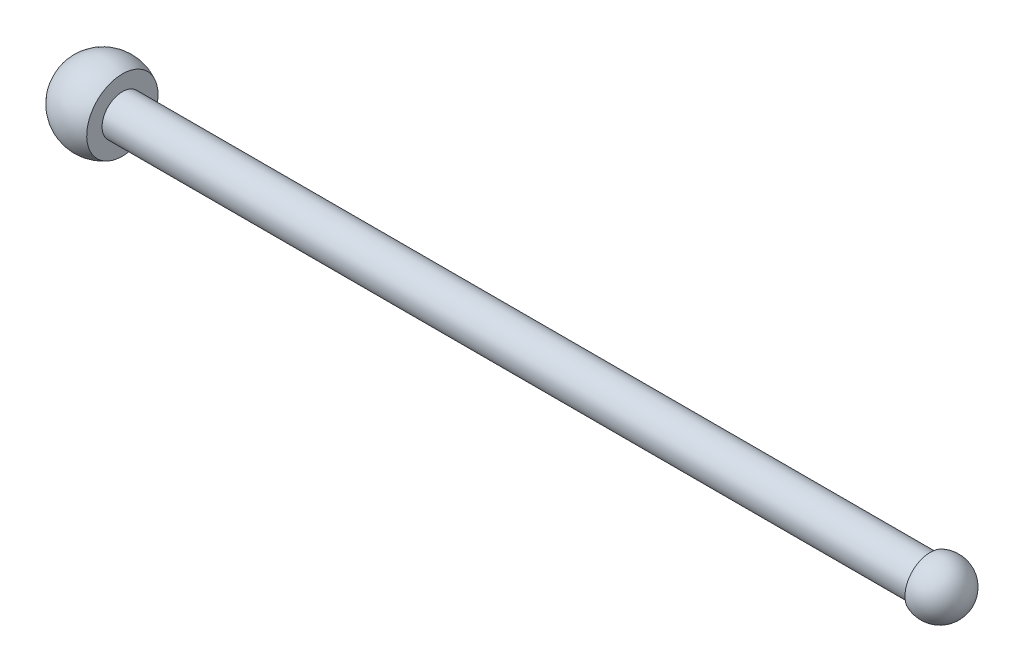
ISO-10303-21;
HEADER;
FILE_DESCRIPTION(('STEP AP214'),'2;1');
FILE_NAME('part.step','',(''),(''),'','','');
FILE_SCHEMA(('AUTOMOTIVE_DESIGN { 1 0 10303 214 1 1 1 1 }'));
ENDSEC;
DATA;
#1=APPLICATION_CONTEXT('core data for automotive mechanical design processes');
#2=APPLICATION_PROTOCOL_DEFINITION('international standard','automotive_design',2000,#1);
#3=PRODUCT_CONTEXT('',#1,'mechanical');
#4=PRODUCT('Part','Part','',(#3));
#5=PRODUCT_RELATED_PRODUCT_CATEGORY('part','',(#4));
#6=PRODUCT_DEFINITION_FORMATION('','',#4);
#7=PRODUCT_DEFINITION_CONTEXT('part definition',#1,'design');
#8=PRODUCT_DEFINITION('design','',#6,#7);
#9=PRODUCT_DEFINITION_SHAPE('','',#8);
#10=(LENGTH_UNIT() NAMED_UNIT(*) SI_UNIT(.MILLI.,.METRE.));
#11=(NAMED_UNIT(*) PLANE_ANGLE_UNIT() SI_UNIT($,.RADIAN.));
#12=(NAMED_UNIT(*) SI_UNIT($,.STERADIAN.) SOLID_ANGLE_UNIT());
#13=UNCERTAINTY_MEASURE_WITH_UNIT(LENGTH_MEASURE(1.E-05),#10,'distance_accuracy_value','');
#14=(GEOMETRIC_REPRESENTATION_CONTEXT(3) GLOBAL_UNCERTAINTY_ASSIGNED_CONTEXT((#13)) GLOBAL_UNIT_ASSIGNED_CONTEXT((#10,
#11,#12)) REPRESENTATION_CONTEXT('',''));
#15=CARTESIAN_POINT('',(0.,0.,0.));
#16=DIRECTION('',(0.,0.,1.));
#17=DIRECTION('',(1.,0.,0.));
#18=AXIS2_PLACEMENT_3D('',#15,#16,#17);
#19=CARTESIAN_POINT('',(192.069433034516,11.8659256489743,0.));
#20=DIRECTION('',(1.,0.,0.));
#21=DIRECTION('',(0.,0.,-1.));
#22=AXIS2_PLACEMENT_3D('',#19,#20,#21);
#23=PLANE('',#22);
#24=DIRECTION('',(0.,-1.,0.));
#25=VECTOR('',#24,1.);
#26=CARTESIAN_POINT('',(192.069433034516,11.8659256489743,0.));
#27=LINE('',#26,#25);
#28=CARTESIAN_POINT('',(192.069433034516,11.8659256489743,0.));
#29=VERTEX_POINT('',#28);
#30=CARTESIAN_POINT('',(192.069433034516,9.525,0.));
#31=VERTEX_POINT('',#30);
#32=EDGE_CURVE('E11',#29,#31,#27,.T.);
#33=ORIENTED_EDGE('',*,*,#32,.F.);
#34=CARTESIAN_POINT('',(192.069433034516,0.,0.));
#35=DIRECTION('',(-1.,0.,0.));
#36=DIRECTION('',(0.,0.,1.));
#37=AXIS2_PLACEMENT_3D('',#34,#35,#36);
#38=CIRCLE('',#37,11.8659256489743);
#39=CARTESIAN_POINT('',(192.069433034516,0.,11.8659256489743));
#40=VERTEX_POINT('',#39);
#41=EDGE_CURVE('E66',#29,#40,#38,.T.);
#42=ORIENTED_EDGE('',*,*,#41,.T.);
#43=DIRECTION('',(0.,0.,1.));
#44=VECTOR('',#43,1.);
#45=CARTESIAN_POINT('',(192.069433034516,0.,0.));
#46=LINE('',#45,#44);
#47=CARTESIAN_POINT('',(192.069433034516,0.,9.525));
#48=VERTEX_POINT('',#47);
#49=EDGE_CURVE('E43',#48,#40,#46,.T.);
#50=ORIENTED_EDGE('',*,*,#49,.F.);
#51=CARTESIAN_POINT('',(192.069433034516,0.,0.));
#52=DIRECTION('',(1.,0.,0.));
#53=DIRECTION('',(0.,0.,-1.));
#54=AXIS2_PLACEMENT_3D('',#51,#52,#53);
#55=CIRCLE('',#54,9.525);
#56=EDGE_CURVE('E71',#48,#31,#55,.T.);
#57=ORIENTED_EDGE('',*,*,#56,.T.);
#58=EDGE_LOOP('',(#33,#42,#50,#57));
#59=FACE_BOUND('',#58,.T.);
#60=ADVANCED_FACE('F34',(#59),#23,.F.);
#61=CARTESIAN_POINT('',(-211.592900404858,0.,0.));
#62=DIRECTION('',(-1.,0.,0.));
#63=DIRECTION('',(0.,0.,1.));
#64=AXIS2_PLACEMENT_3D('',#61,#62,#63);
#65=CYLINDRICAL_SURFACE('',#64,9.525);
#66=CARTESIAN_POINT('',(-187.532514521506,0.,0.));
#67=DIRECTION('',(1.,0.,0.));
#68=DIRECTION('',(0.,0.,-1.));
#69=AXIS2_PLACEMENT_3D('',#66,#67,#68);
#70=CIRCLE('',#69,9.525);
#71=CARTESIAN_POINT('',(-187.532514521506,0.,-9.525));
#72=VERTEX_POINT('',#71);
#73=EDGE_CURVE('E68',#72,#72,#70,.T.);
#74=ORIENTED_EDGE('',*,*,#73,.T.);
#75=EDGE_LOOP('',(#74));
#76=FACE_BOUND('',#75,.T.);
#77=EDGE_CURVE('E63',#31,#48,#55,.T.);
#78=ORIENTED_EDGE('',*,*,#77,.F.);
#79=ORIENTED_EDGE('',*,*,#56,.F.);
#80=EDGE_LOOP('',(#78,#79));
#81=FACE_BOUND('',#80,.T.);
#82=ADVANCED_FACE('F36',(#76,#81),#65,.T.);
#83=EDGE_CURVE('E61',#40,#29,#38,.T.);
#84=ORIENTED_EDGE('',*,*,#83,.T.);
#85=ORIENTED_EDGE('',*,*,#32,.T.);
#86=ORIENTED_EDGE('',*,*,#77,.T.);
#87=ORIENTED_EDGE('',*,*,#49,.T.);
#88=EDGE_LOOP('',(#84,#85,#86,#87));
#89=FACE_BOUND('',#88,.T.);
#90=ADVANCED_FACE('F59',(#89),#23,.F.);
#91=CARTESIAN_POINT('',(196.596,0.,0.));
#92=DIRECTION('',(-1.,0.,0.));
#93=DIRECTION('',(0.,1.,0.));
#94=AXIS2_PLACEMENT_3D('',#91,#92,#93);
#95=SPHERICAL_SURFACE('',#94,12.7);
#96=ORIENTED_EDGE('',*,*,#83,.F.);
#97=ORIENTED_EDGE('',*,*,#41,.F.);
#98=EDGE_LOOP('',(#96,#97));
#99=FACE_BOUND('',#98,.T.);
#100=ADVANCED_FACE('F70',(#99),#95,.T.);
#101=CARTESIAN_POINT('',(-187.532514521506,16.7557670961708,0.));
#102=DIRECTION('',(1.,0.,0.));
#103=DIRECTION('',(0.,0.,-1.));
#104=AXIS2_PLACEMENT_3D('',#101,#102,#103);
#105=PLANE('',#104);
#106=CARTESIAN_POINT('',(-187.532514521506,0.,0.));
#107=DIRECTION('',(1.,0.,0.));
#108=DIRECTION('',(0.,0.,-1.));
#109=AXIS2_PLACEMENT_3D('',#106,#107,#108);
#110=CIRCLE('',#109,16.7557670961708);
#111=CARTESIAN_POINT('',(-187.532514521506,0.,-16.7557670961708));
#112=VERTEX_POINT('',#111);
#113=EDGE_CURVE('E74',#112,#112,#110,.T.);
#114=ORIENTED_EDGE('',*,*,#113,.T.);
#115=EDGE_LOOP('',(#114));
#116=FACE_BOUND('',#115,.T.);
#117=ORIENTED_EDGE('',*,*,#73,.F.);
#118=EDGE_LOOP('',(#117));
#119=FACE_BOUND('',#118,.T.);
#120=ADVANCED_FACE('F82',(#116,#119),#105,.T.);
#121=CARTESIAN_POINT('',(-196.596,0.,0.));
#122=DIRECTION('',(1.,0.,0.));
#123=DIRECTION('',(0.,1.,0.));
#124=AXIS2_PLACEMENT_3D('',#121,#122,#123);
#125=SPHERICAL_SURFACE('',#124,19.05);
#126=ORIENTED_EDGE('',*,*,#113,.F.);
#127=EDGE_LOOP('',(#126));
#128=FACE_BOUND('',#127,.T.);
#129=ADVANCED_FACE('F85',(#128),#125,.T.);
#130=CLOSED_SHELL('',(#60,#82,#90,#100,#120,#129));
#131=MANIFOLD_SOLID_BREP('B2',#130);
#132=ADVANCED_BREP_SHAPE_REPRESENTATION('',(#18,#131),#14);
#133=SHAPE_DEFINITION_REPRESENTATION(#9,#132);
ENDSEC;
END-ISO-10303-21;
